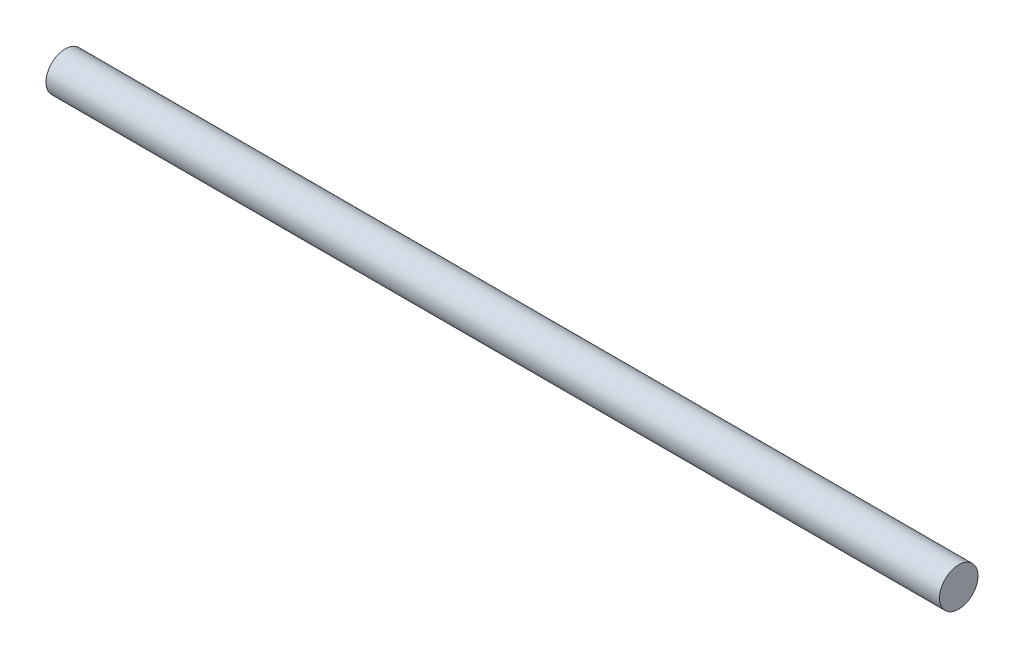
from build123d import *

# Parameters (mm, degrees)
SKETCH1_R         = 4
SCREWLENGTH_DEPTH = 185.672


with BuildPart() as part:
    # Sketch1 → SCREWLength (new body)
    with BuildSketch(Plane(origin=(0, 0, 0), x_dir=(0, 0, -1), z_dir=(1, 0, 0))):
        Circle(SKETCH1_R)
    extrude(amount=SCREWLENGTH_DEPTH)


solid = part.part
